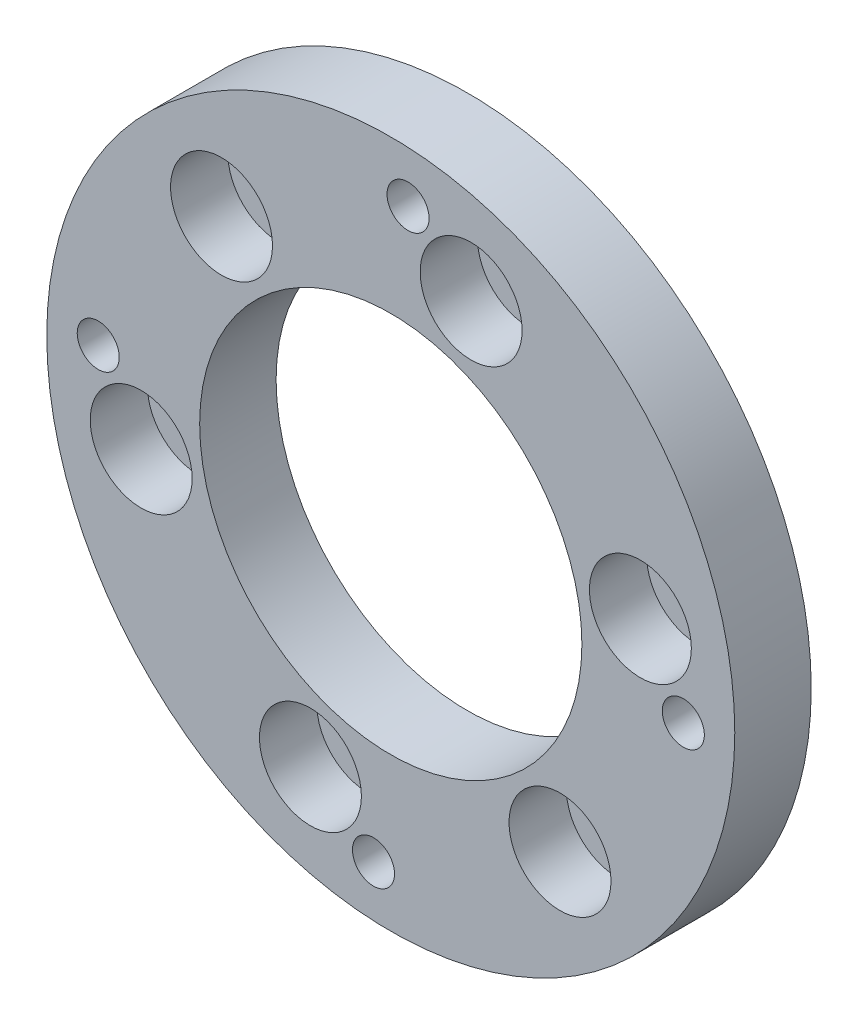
from build123d import *

# Parameters (mm, degrees)
ESQUISSE5_R                                     = 27
ESQUISSE5_R_2                                   = 15
BASE_EXTRUSION_DEPTH                            = 6
TROU_TARAUD_M4X0_71_D                           = 3.3
R_P_TITION_CIRCULAIRE1_COUNT                    = 4
CHAMBRAGE_POUR_VIS_T_TE_CYLINDRIQUE_D           = 4.5
CHAMBRAGE_POUR_VIS_T_TE_CYLINDRIQUE_CBORE_D     = 8
CHAMBRAGE_POUR_VIS_T_TE_CYLINDRIQUE_CBORE_DEPTH = 4.5
R_P_TITION_CIRCULAIRE2_COUNT                    = 6


with BuildPart() as part:
    # Esquisse5 → Base-Extrusion (new body)
    with BuildSketch(Plane.XY):
        with Locations(Location((0, 0, 0), (0, 0, 180))):
            Circle(ESQUISSE5_R)
        with Locations(Location((0, 0, 0), (0, 0, 180))):
            Circle(ESQUISSE5_R_2, mode=Mode.SUBTRACT)
    extrude(amount=BASE_EXTRUSION_DEPTH)

    # Trou taraud_ M4x0.71 (through all)
    with Locations(Plane(origin=(0, 0, 0), x_dir=(-1, 0, 0), z_dir=(0, 0, -1))):
        with Locations((22.959989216, 1.356058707)):
            trou_taraud_m4x0_71 = Hole(TROU_TARAUD_M4X0_71_D / 2)

    # R_p_tition circulaire1: Trou taraud_ M4x0.71 ×4 about axis
    r_p_tition_circulaire1_axis = Axis((0, 0, 0), (0, 0, -1))
    for i in range(1, R_P_TITION_CIRCULAIRE1_COUNT):
        add(trou_taraud_m4x0_71.rotate(r_p_tition_circulaire1_axis, i * 360 / R_P_TITION_CIRCULAIRE1_COUNT), mode=Mode.SUBTRACT)

    # Chambrage pour vis _ t_te cylindrique (through all)
    with Locations(Plane.XY.offset(6)):
        with Locations((-13.28372675, 14.951341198)):
            chambrage_pour_vis_t_te_cylindrique = CounterBoreHole(CHAMBRAGE_POUR_VIS_T_TE_CYLINDRIQUE_D / 2, CHAMBRAGE_POUR_VIS_T_TE_CYLINDRIQUE_CBORE_D / 2, CHAMBRAGE_POUR_VIS_T_TE_CYLINDRIQUE_CBORE_DEPTH)

    # R_p_tition circulaire2: Chambrage pour vis _ t_te cylindrique ×6 about axis
    r_p_tition_circulaire2_axis = Axis((0, 0, 0), (0, 0, -1))
    for i in range(1, R_P_TITION_CIRCULAIRE2_COUNT):
        add(chambrage_pour_vis_t_te_cylindrique.rotate(r_p_tition_circulaire2_axis, i * 360 / R_P_TITION_CIRCULAIRE2_COUNT), mode=Mode.SUBTRACT)


solid = part.part
